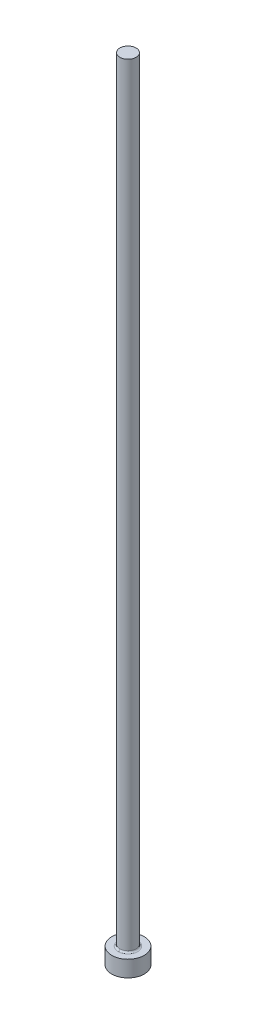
ISO-10303-21;
HEADER;
FILE_DESCRIPTION(('STEP AP214'),'2;1');
FILE_NAME('part.step','',(''),(''),'','','');
FILE_SCHEMA(('AUTOMOTIVE_DESIGN { 1 0 10303 214 1 1 1 1 }'));
ENDSEC;
DATA;
#1=APPLICATION_CONTEXT('core data for automotive mechanical design processes');
#2=APPLICATION_PROTOCOL_DEFINITION('international standard','automotive_design',2000,#1);
#3=PRODUCT_CONTEXT('',#1,'mechanical');
#4=PRODUCT('Part','Part','',(#3));
#5=PRODUCT_RELATED_PRODUCT_CATEGORY('part','',(#4));
#6=PRODUCT_DEFINITION_FORMATION('','',#4);
#7=PRODUCT_DEFINITION_CONTEXT('part definition',#1,'design');
#8=PRODUCT_DEFINITION('design','',#6,#7);
#9=PRODUCT_DEFINITION_SHAPE('','',#8);
#10=(LENGTH_UNIT() NAMED_UNIT(*) SI_UNIT(.MILLI.,.METRE.));
#11=(NAMED_UNIT(*) PLANE_ANGLE_UNIT() SI_UNIT($,.RADIAN.));
#12=(NAMED_UNIT(*) SI_UNIT($,.STERADIAN.) SOLID_ANGLE_UNIT());
#13=UNCERTAINTY_MEASURE_WITH_UNIT(LENGTH_MEASURE(1.E-05),#10,'distance_accuracy_value','');
#14=(GEOMETRIC_REPRESENTATION_CONTEXT(3) GLOBAL_UNCERTAINTY_ASSIGNED_CONTEXT((#13)) GLOBAL_UNIT_ASSIGNED_CONTEXT((#10,
#11,#12)) REPRESENTATION_CONTEXT('',''));
#15=CARTESIAN_POINT('',(0.,0.,0.));
#16=DIRECTION('',(0.,0.,1.));
#17=DIRECTION('',(1.,0.,0.));
#18=AXIS2_PLACEMENT_3D('',#15,#16,#17);
#19=CARTESIAN_POINT('',(-11.6785,-106.,107.776));
#20=DIRECTION('',(0.,-1.,0.));
#21=DIRECTION('',(0.,0.,1.));
#22=AXIS2_PLACEMENT_3D('',#19,#20,#21);
#23=PLANE('',#22);
#24=CARTESIAN_POINT('',(-13.7025,-106.,109.8));
#25=DIRECTION('',(0.,1.,0.));
#26=DIRECTION('',(-1.,0.,0.));
#27=AXIS2_PLACEMENT_3D('',#24,#25,#26);
#28=CIRCLE('',#27,2.);
#29=CARTESIAN_POINT('',(-15.7025,-106.,109.8));
#30=VERTEX_POINT('',#29);
#31=EDGE_CURVE('E21',#30,#30,#28,.F.);
#32=ORIENTED_EDGE('',*,*,#31,.T.);
#33=EDGE_LOOP('',(#32));
#34=FACE_BOUND('',#33,.T.);
#35=ADVANCED_FACE('F16',(#34),#23,.T.);
#36=CARTESIAN_POINT('',(-13.7025,-106.,109.8));
#37=DIRECTION('',(0.,1.,0.));
#38=DIRECTION('',(-1.,0.,0.));
#39=AXIS2_PLACEMENT_3D('',#36,#37,#38);
#40=CYLINDRICAL_SURFACE('',#39,2.);
#41=CARTESIAN_POINT('',(-13.7025,-104.,109.8));
#42=DIRECTION('',(0.,1.,0.));
#43=DIRECTION('',(-1.,0.,0.));
#44=AXIS2_PLACEMENT_3D('',#41,#42,#43);
#45=CIRCLE('',#44,2.);
#46=CARTESIAN_POINT('',(-15.7025,-104.,109.8));
#47=VERTEX_POINT('',#46);
#48=EDGE_CURVE('E58',#47,#47,#45,.T.);
#49=ORIENTED_EDGE('',*,*,#48,.F.);
#50=EDGE_LOOP('',(#49));
#51=FACE_BOUND('',#50,.T.);
#52=ORIENTED_EDGE('',*,*,#31,.F.);
#53=EDGE_LOOP('',(#52));
#54=FACE_BOUND('',#53,.T.);
#55=ADVANCED_FACE('F93',(#51,#54),#40,.T.);
#56=CARTESIAN_POINT('',(-13.7025,-103.999000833,108.580033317));
#57=CARTESIAN_POINT('',(-16.142433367,-103.999000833,108.580033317));
#58=CARTESIAN_POINT('',(-16.142433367,-103.999000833,111.019966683));
#59=CARTESIAN_POINT('',(-13.7025,-103.999000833,111.019966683));
#60=CARTESIAN_POINT('',(-13.7025,-104.012644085,108.716010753));
#61=CARTESIAN_POINT('',(-15.870478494,-104.012644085,108.716010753));
#62=CARTESIAN_POINT('',(-15.870478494,-104.012644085,110.883989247));
#63=CARTESIAN_POINT('',(-13.7025,-104.012644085,110.883989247));
#64=CARTESIAN_POINT('',(-13.7025,-103.916010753,108.812644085));
#65=CARTESIAN_POINT('',(-15.677211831,-103.916010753,108.812644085));
#66=CARTESIAN_POINT('',(-15.677211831,-103.916010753,110.787355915));
#67=CARTESIAN_POINT('',(-13.7025,-103.916010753,110.787355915));
#68=CARTESIAN_POINT('',(-13.7025,-103.780033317,108.799000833));
#69=CARTESIAN_POINT('',(-15.704498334,-103.780033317,108.799000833));
#70=CARTESIAN_POINT('',(-15.704498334,-103.780033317,110.800999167));
#71=CARTESIAN_POINT('',(-13.7025,-103.780033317,110.800999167));
#72=(BOUNDED_SURFACE() B_SPLINE_SURFACE(3,3,((#56,#57,#58,#59),(#60,#61,#62,#63),(#64,#65,#66,
#67),(#68,#69,#70,#71)),.UNSPECIFIED.,.F.,.F.,.F.) B_SPLINE_SURFACE_WITH_KNOTS((4,4),(4,4),(0.,
1.),(0.,1.),.UNSPECIFIED.) GEOMETRIC_REPRESENTATION_ITEM() RATIONAL_B_SPLINE_SURFACE(((1.,
0.333333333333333,0.333333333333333,1.),(0.755320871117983,0.251773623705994,0.251773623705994,
0.755320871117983),(0.755320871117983,0.251773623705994,0.251773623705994,0.755320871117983),
(1.,0.333333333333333,0.333333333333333,1.))) REPRESENTATION_ITEM('') SURFACE());
#73=CARTESIAN_POINT('',(-13.7025,-103.8,109.8));
#74=DIRECTION('',(0.,1.,0.));
#75=DIRECTION('',(0.,0.,-1.));
#76=AXIS2_PLACEMENT_3D('',#73,#74,#75);
#77=CIRCLE('',#76,1.);
#78=CARTESIAN_POINT('',(-13.7024999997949,-103.800000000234,110.799999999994));
#79=VERTEX_POINT('',#78);
#80=CARTESIAN_POINT('',(-13.7024999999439,-103.80000000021,108.800000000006));
#81=VERTEX_POINT('',#80);
#82=EDGE_CURVE('E51',#79,#81,#77,.F.);
#83=CARTESIAN_POINT('',(-13.7025,-103.999000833,108.580033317));
#84=CARTESIAN_POINT('',(-13.7025,-104.012644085,108.716010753));
#85=CARTESIAN_POINT('',(-13.7025,-103.916010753,108.812644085));
#86=CARTESIAN_POINT('',(-13.7025,-103.780033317,108.799000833));
#87=(BOUNDED_CURVE() B_SPLINE_CURVE(3,(#83,#84,#85,#86),.UNSPECIFIED.,.F.,
.F.) B_SPLINE_CURVE_WITH_KNOTS((4,4),(0.,1.),
.UNSPECIFIED.) CURVE() GEOMETRIC_REPRESENTATION_ITEM() RATIONAL_B_SPLINE_CURVE((1.,
0.755320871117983,0.755320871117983,1.)) REPRESENTATION_ITEM(''));
#88=CARTESIAN_POINT('',(-13.7025,-104.000000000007,108.599999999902));
#89=VERTEX_POINT('',#88);
#90=EDGE_CURVE('E45',#89,#81,#87,.T.);
#91=CARTESIAN_POINT('',(-13.7025,-104.000000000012,108.600000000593));
#92=CARTESIAN_POINT('',(-16.1024999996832,-104.000000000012,108.600000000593));
#93=CARTESIAN_POINT('',(-16.1024999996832,-104.000000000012,110.999999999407));
#94=CARTESIAN_POINT('',(-13.7025,-104.000000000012,110.999999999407));
#95=(BOUNDED_CURVE() B_SPLINE_CURVE(3,(#91,#92,#93,#94),.UNSPECIFIED.,.F.,
.F.) B_SPLINE_CURVE_WITH_KNOTS((4,4),(0.,1.),
.UNSPECIFIED.) CURVE() GEOMETRIC_REPRESENTATION_ITEM() RATIONAL_B_SPLINE_CURVE((0.956578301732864,
0.318859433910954,0.318859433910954,0.956578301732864)) REPRESENTATION_ITEM(''));
#96=CARTESIAN_POINT('',(-13.7025,-104.000000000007,111.000000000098));
#97=VERTEX_POINT('',#96);
#98=EDGE_CURVE('E48',#97,#89,#95,.F.);
#99=CARTESIAN_POINT('',(-13.7025,-103.999000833,111.019966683));
#100=CARTESIAN_POINT('',(-13.7025,-104.012644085,110.883989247));
#101=CARTESIAN_POINT('',(-13.7025,-103.916010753,110.787355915));
#102=CARTESIAN_POINT('',(-13.7025,-103.780033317,110.800999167));
#103=(BOUNDED_CURVE() B_SPLINE_CURVE(3,(#99,#100,#101,#102),.UNSPECIFIED.,.F.,
.F.) B_SPLINE_CURVE_WITH_KNOTS((4,4),(0.,1.),
.UNSPECIFIED.) CURVE() GEOMETRIC_REPRESENTATION_ITEM() RATIONAL_B_SPLINE_CURVE((1.,
0.755320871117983,0.755320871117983,1.)) REPRESENTATION_ITEM(''));
#104=EDGE_CURVE('E36',#79,#97,#103,.F.);
#105=ORIENTED_EDGE('',*,*,#82,.T.);
#106=ORIENTED_EDGE('',*,*,#90,.F.);
#107=ORIENTED_EDGE('',*,*,#98,.F.);
#108=ORIENTED_EDGE('',*,*,#104,.F.);
#109=EDGE_LOOP('',(#105,#106,#107,#108));
#110=FACE_BOUND('',#109,.T.);
#111=ADVANCED_FACE('F47',(#110),#72,.F.);
#112=CARTESIAN_POINT('',(-14.7145,-8.6275,108.788));
#113=DIRECTION('',(0.,1.,0.));
#114=DIRECTION('',(0.,0.,1.));
#115=AXIS2_PLACEMENT_3D('',#112,#113,#114);
#116=PLANE('',#115);
#117=CARTESIAN_POINT('',(-13.7025,-8.6275,109.8));
#118=DIRECTION('',(0.,1.,0.));
#119=DIRECTION('',(0.,0.,1.));
#120=AXIS2_PLACEMENT_3D('',#117,#118,#119);
#121=CIRCLE('',#120,1.);
#122=CARTESIAN_POINT('',(-13.7025,-8.6275,110.8));
#123=VERTEX_POINT('',#122);
#124=EDGE_CURVE('E57',#123,#123,#121,.T.);
#125=ORIENTED_EDGE('',*,*,#124,.T.);
#126=EDGE_LOOP('',(#125));
#127=FACE_BOUND('',#126,.T.);
#128=ADVANCED_FACE('F92',(#127),#116,.T.);
#129=CARTESIAN_POINT('',(-11.6785,-104.,111.824));
#130=DIRECTION('',(0.,1.,0.));
#131=DIRECTION('',(0.,0.,-1.));
#132=AXIS2_PLACEMENT_3D('',#129,#130,#131);
#133=PLANE('',#132);
#134=CARTESIAN_POINT('',(-13.7025,-104.000000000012,110.999999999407));
#135=CARTESIAN_POINT('',(-11.3025000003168,-104.000000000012,110.999999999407));
#136=CARTESIAN_POINT('',(-11.3025000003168,-104.000000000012,108.600000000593));
#137=CARTESIAN_POINT('',(-13.7025,-104.000000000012,108.600000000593));
#138=(BOUNDED_CURVE() B_SPLINE_CURVE(3,(#134,#135,#136,#137),.UNSPECIFIED.,.F.,
.F.) B_SPLINE_CURVE_WITH_KNOTS((4,4),(0.,1.),
.UNSPECIFIED.) CURVE() GEOMETRIC_REPRESENTATION_ITEM() RATIONAL_B_SPLINE_CURVE((0.95657830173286,
0.318859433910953,0.318859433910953,0.95657830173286)) REPRESENTATION_ITEM(''));
#139=EDGE_CURVE('E27',#89,#97,#138,.F.);
#140=ORIENTED_EDGE('',*,*,#139,.T.);
#141=ORIENTED_EDGE('',*,*,#98,.T.);
#142=EDGE_LOOP('',(#140,#141));
#143=FACE_BOUND('',#142,.T.);
#144=ORIENTED_EDGE('',*,*,#48,.T.);
#145=EDGE_LOOP('',(#144));
#146=FACE_BOUND('',#145,.T.);
#147=ADVANCED_FACE('F18',(#143,#146),#133,.T.);
#148=CARTESIAN_POINT('',(-13.7025,-103.8,109.8));
#149=DIRECTION('',(0.,1.,0.));
#150=DIRECTION('',(0.,0.,1.));
#151=AXIS2_PLACEMENT_3D('',#148,#149,#150);
#152=CYLINDRICAL_SURFACE('',#151,1.);
#153=CARTESIAN_POINT('',(-13.7025,-103.800000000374,109.8));
#154=DIRECTION('',(0.,1.,0.));
#155=DIRECTION('',(0.,0.,1.));
#156=AXIS2_PLACEMENT_3D('',#153,#154,#155);
#157=CIRCLE('',#156,0.999999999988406);
#158=EDGE_CURVE('E11',#79,#81,#157,.T.);
#159=ORIENTED_EDGE('',*,*,#158,.T.);
#160=ORIENTED_EDGE('',*,*,#82,.F.);
#161=EDGE_LOOP('',(#159,#160));
#162=FACE_BOUND('',#161,.T.);
#163=ORIENTED_EDGE('',*,*,#124,.F.);
#164=EDGE_LOOP('',(#163));
#165=FACE_BOUND('',#164,.T.);
#166=ADVANCED_FACE('F78',(#162,#165),#152,.T.);
#167=CARTESIAN_POINT('',(-13.7025,-103.999000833,111.019966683));
#168=CARTESIAN_POINT('',(-11.262566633,-103.999000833,111.019966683));
#169=CARTESIAN_POINT('',(-11.262566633,-103.999000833,108.580033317));
#170=CARTESIAN_POINT('',(-13.7025,-103.999000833,108.580033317));
#171=CARTESIAN_POINT('',(-13.7025,-104.012644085,110.883989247));
#172=CARTESIAN_POINT('',(-11.534521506,-104.012644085,110.883989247));
#173=CARTESIAN_POINT('',(-11.534521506,-104.012644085,108.716010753));
#174=CARTESIAN_POINT('',(-13.7025,-104.012644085,108.716010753));
#175=CARTESIAN_POINT('',(-13.7025,-103.916010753,110.787355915));
#176=CARTESIAN_POINT('',(-11.727788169,-103.916010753,110.787355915));
#177=CARTESIAN_POINT('',(-11.727788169,-103.916010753,108.812644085));
#178=CARTESIAN_POINT('',(-13.7025,-103.916010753,108.812644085));
#179=CARTESIAN_POINT('',(-13.7025,-103.780033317,110.800999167));
#180=CARTESIAN_POINT('',(-11.700501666,-103.780033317,110.800999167));
#181=CARTESIAN_POINT('',(-11.700501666,-103.780033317,108.799000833));
#182=CARTESIAN_POINT('',(-13.7025,-103.780033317,108.799000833));
#183=(BOUNDED_SURFACE() B_SPLINE_SURFACE(3,3,((#167,#168,#169,#170),(#171,#172,#173,#174),(#175,
#176,#177,#178),(#179,#180,#181,#182)),.UNSPECIFIED.,.F.,.F.,
.F.) B_SPLINE_SURFACE_WITH_KNOTS((4,4),(4,4),(0.,1.),(0.,1.),
.UNSPECIFIED.) GEOMETRIC_REPRESENTATION_ITEM() RATIONAL_B_SPLINE_SURFACE(((1.,0.333333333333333,
0.333333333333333,1.),(0.755320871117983,0.251773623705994,0.251773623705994,0.755320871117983),
(0.755320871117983,0.251773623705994,0.251773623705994,0.755320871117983),(1.,0.333333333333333,
0.333333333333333,1.))) REPRESENTATION_ITEM('') SURFACE());
#184=ORIENTED_EDGE('',*,*,#104,.T.);
#185=ORIENTED_EDGE('',*,*,#139,.F.);
#186=ORIENTED_EDGE('',*,*,#90,.T.);
#187=ORIENTED_EDGE('',*,*,#158,.F.);
#188=EDGE_LOOP('',(#184,#185,#186,#187));
#189=FACE_BOUND('',#188,.T.);
#190=ADVANCED_FACE('F62',(#189),#183,.F.);
#191=CLOSED_SHELL('',(#35,#55,#111,#128,#147,#166,#190));
#192=MANIFOLD_SOLID_BREP('B1',#191);
#193=ADVANCED_BREP_SHAPE_REPRESENTATION('',(#18,#192),#14);
#194=SHAPE_DEFINITION_REPRESENTATION(#9,#193);
ENDSEC;
END-ISO-10303-21;
